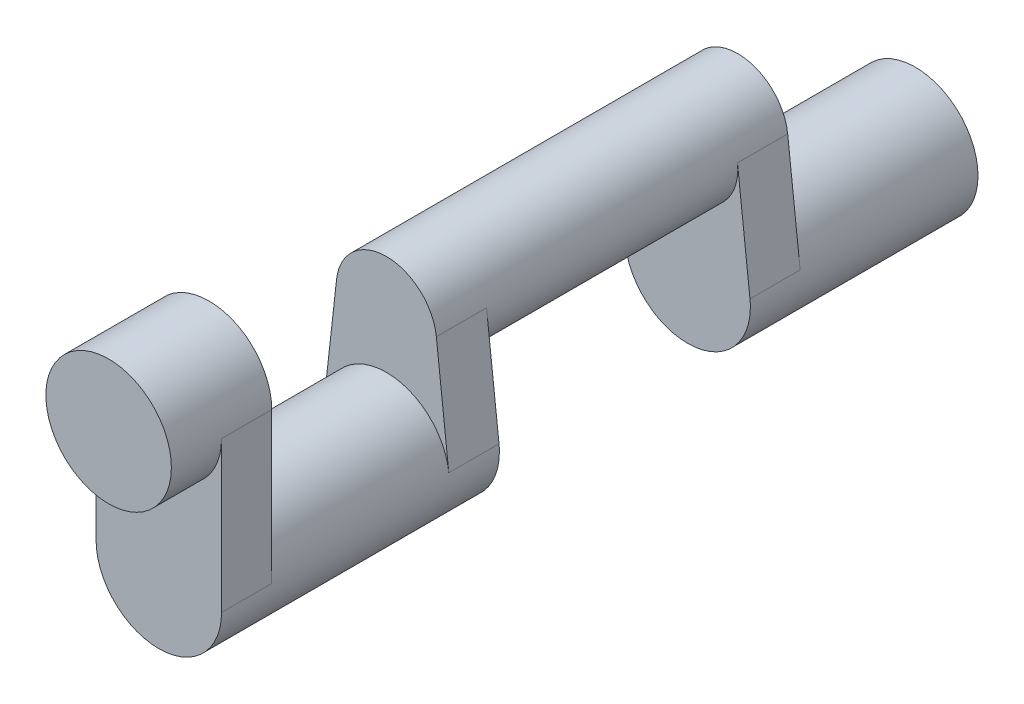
ISO-10303-21;
HEADER;
FILE_DESCRIPTION(('STEP AP214'),'2;1');
FILE_NAME('part.step','',(''),(''),'','','');
FILE_SCHEMA(('AUTOMOTIVE_DESIGN { 1 0 10303 214 1 1 1 1 }'));
ENDSEC;
DATA;
#1=APPLICATION_CONTEXT('core data for automotive mechanical design processes');
#2=APPLICATION_PROTOCOL_DEFINITION('international standard','automotive_design',2000,#1);
#3=PRODUCT_CONTEXT('',#1,'mechanical');
#4=PRODUCT('Part','Part','',(#3));
#5=PRODUCT_RELATED_PRODUCT_CATEGORY('part','',(#4));
#6=PRODUCT_DEFINITION_FORMATION('','',#4);
#7=PRODUCT_DEFINITION_CONTEXT('part definition',#1,'design');
#8=PRODUCT_DEFINITION('design','',#6,#7);
#9=PRODUCT_DEFINITION_SHAPE('','',#8);
#10=(LENGTH_UNIT() NAMED_UNIT(*) SI_UNIT(.MILLI.,.METRE.));
#11=(NAMED_UNIT(*) PLANE_ANGLE_UNIT() SI_UNIT($,.RADIAN.));
#12=(NAMED_UNIT(*) SI_UNIT($,.STERADIAN.) SOLID_ANGLE_UNIT());
#13=UNCERTAINTY_MEASURE_WITH_UNIT(LENGTH_MEASURE(1.E-05),#10,'distance_accuracy_value','');
#14=(GEOMETRIC_REPRESENTATION_CONTEXT(3) GLOBAL_UNCERTAINTY_ASSIGNED_CONTEXT((#13)) GLOBAL_UNIT_ASSIGNED_CONTEXT((#10,
#11,#12)) REPRESENTATION_CONTEXT('',''));
#15=CARTESIAN_POINT('',(0.,0.,0.));
#16=DIRECTION('',(0.,0.,1.));
#17=DIRECTION('',(1.,0.,0.));
#18=AXIS2_PLACEMENT_3D('',#15,#16,#17);
#19=CARTESIAN_POINT('',(0.,0.,38.1));
#20=DIRECTION('',(0.,0.,-1.));
#21=DIRECTION('',(-1.,0.,0.));
#22=AXIS2_PLACEMENT_3D('',#19,#20,#21);
#23=PLANE('',#22);
#24=CARTESIAN_POINT('',(0.,76.2,38.1));
#25=DIRECTION('',(0.,0.,1.));
#26=DIRECTION('',(1.,0.,0.));
#27=AXIS2_PLACEMENT_3D('',#24,#25,#26);
#28=CIRCLE('',#27,31.75);
#29=CARTESIAN_POINT('',(-31.75,76.2,38.1));
#30=VERTEX_POINT('',#29);
#31=CARTESIAN_POINT('',(31.75,76.2,38.1));
#32=VERTEX_POINT('',#31);
#33=EDGE_CURVE('E11',#30,#32,#28,.T.);
#34=ORIENTED_EDGE('',*,*,#33,.F.);
#35=DIRECTION('',(0.,-1.,0.));
#36=VECTOR('',#35,1.);
#37=CARTESIAN_POINT('',(-31.75,0.,38.1));
#38=LINE('',#37,#36);
#39=CARTESIAN_POINT('',(-31.75,0.,38.1));
#40=VERTEX_POINT('',#39);
#41=EDGE_CURVE('E142',#30,#40,#38,.T.);
#42=ORIENTED_EDGE('',*,*,#41,.T.);
#43=CARTESIAN_POINT('',(0.,0.,38.1));
#44=DIRECTION('',(0.,0.,1.));
#45=DIRECTION('',(-1.,0.,0.));
#46=AXIS2_PLACEMENT_3D('',#43,#44,#45);
#47=CIRCLE('',#46,31.75);
#48=CARTESIAN_POINT('',(31.75,0.,38.1));
#49=VERTEX_POINT('',#48);
#50=EDGE_CURVE('E140',#40,#49,#47,.T.);
#51=ORIENTED_EDGE('',*,*,#50,.T.);
#52=DIRECTION('',(0.,1.,0.));
#53=VECTOR('',#52,1.);
#54=CARTESIAN_POINT('',(31.75,0.,38.1));
#55=LINE('',#54,#53);
#56=EDGE_CURVE('E129',#49,#32,#55,.T.);
#57=ORIENTED_EDGE('',*,*,#56,.T.);
#58=EDGE_LOOP('',(#34,#42,#51,#57));
#59=FACE_BOUND('',#58,.T.);
#60=ADVANCED_FACE('F33',(#59),#23,.F.);
#61=CARTESIAN_POINT('',(0.,0.,-102.501929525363));
#62=DIRECTION('',(0.,0.,1.));
#63=DIRECTION('',(1.,0.,0.));
#64=AXIS2_PLACEMENT_3D('',#61,#62,#63);
#65=PLANE('',#64);
#66=CARTESIAN_POINT('',(0.,57.15,-102.501929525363));
#67=DIRECTION('',(0.,0.,-1.));
#68=DIRECTION('',(-1.,0.,0.));
#69=AXIS2_PLACEMENT_3D('',#66,#67,#68);
#70=CIRCLE('',#69,25.4);
#71=CARTESIAN_POINT('',(25.2427229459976,59.9722222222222,-102.501929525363));
#72=VERTEX_POINT('',#71);
#73=CARTESIAN_POINT('',(-25.2427229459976,59.9722222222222,-102.501929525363));
#74=VERTEX_POINT('',#73);
#75=EDGE_CURVE('E42',#72,#74,#70,.T.);
#76=ORIENTED_EDGE('',*,*,#75,.F.);
#77=DIRECTION('',(0.111111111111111,-0.993807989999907,0.));
#78=VECTOR('',#77,1.);
#79=CARTESIAN_POINT('',(31.553403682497,3.52777777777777,-102.501929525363));
#80=LINE('',#79,#78);
#81=CARTESIAN_POINT('',(31.553403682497,3.52777777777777,-102.501929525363));
#82=VERTEX_POINT('',#81);
#83=EDGE_CURVE('E185',#72,#82,#80,.T.);
#84=ORIENTED_EDGE('',*,*,#83,.T.);
#85=CARTESIAN_POINT('',(0.,0.,-102.501929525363));
#86=DIRECTION('',(0.,0.,-1.));
#87=DIRECTION('',(1.,0.,0.));
#88=AXIS2_PLACEMENT_3D('',#85,#86,#87);
#89=CIRCLE('',#88,31.75);
#90=CARTESIAN_POINT('',(-31.553403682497,3.52777777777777,-102.501929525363));
#91=VERTEX_POINT('',#90);
#92=EDGE_CURVE('E209',#82,#91,#89,.T.);
#93=ORIENTED_EDGE('',*,*,#92,.T.);
#94=DIRECTION('',(0.111111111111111,0.993807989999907,0.));
#95=VECTOR('',#94,1.);
#96=CARTESIAN_POINT('',(-31.553403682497,3.52777777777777,-102.501929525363));
#97=LINE('',#96,#95);
#98=EDGE_CURVE('E188',#91,#74,#97,.T.);
#99=ORIENTED_EDGE('',*,*,#98,.T.);
#100=EDGE_LOOP('',(#76,#84,#93,#99));
#101=FACE_BOUND('',#100,.T.);
#102=ADVANCED_FACE('F257',(#101),#65,.F.);
#103=CARTESIAN_POINT('',(0.,0.,-166.904490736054));
#104=DIRECTION('',(0.,0.,1.));
#105=DIRECTION('',(1.,0.,0.));
#106=AXIS2_PLACEMENT_3D('',#103,#104,#105);
#107=CYLINDRICAL_SURFACE('',#106,31.75);
#108=CARTESIAN_POINT('',(0.,0.,-77.1019295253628));
#109=DIRECTION('',(0.,0.,1.));
#110=DIRECTION('',(1.,0.,0.));
#111=AXIS2_PLACEMENT_3D('',#108,#109,#110);
#112=CIRCLE('',#111,31.75);
#113=CARTESIAN_POINT('',(-31.553403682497,3.52777777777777,-77.1019295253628));
#114=VERTEX_POINT('',#113);
#115=CARTESIAN_POINT('',(31.553403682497,3.52777777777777,-77.1019295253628));
#116=VERTEX_POINT('',#115);
#117=EDGE_CURVE('E58',#114,#116,#112,.F.);
#118=ORIENTED_EDGE('',*,*,#117,.F.);
#119=DIRECTION('',(0.,0.,1.));
#120=VECTOR('',#119,1.);
#121=CARTESIAN_POINT('',(-31.553403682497,3.52777777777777,-102.501929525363));
#122=LINE('',#121,#120);
#123=EDGE_CURVE('E182',#91,#114,#122,.T.);
#124=ORIENTED_EDGE('',*,*,#123,.F.);
#125=ORIENTED_EDGE('',*,*,#92,.F.);
#126=DIRECTION('',(0.,0.,1.));
#127=VECTOR('',#126,1.);
#128=CARTESIAN_POINT('',(31.553403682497,3.52777777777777,-102.501929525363));
#129=LINE('',#128,#127);
#130=EDGE_CURVE('E187',#82,#116,#129,.T.);
#131=ORIENTED_EDGE('',*,*,#130,.T.);
#132=EDGE_LOOP('',(#118,#124,#125,#131));
#133=FACE_BOUND('',#132,.T.);
#134=CARTESIAN_POINT('',(0.,0.,12.7));
#135=DIRECTION('',(0.,0.,1.));
#136=DIRECTION('',(1.,0.,0.));
#137=AXIS2_PLACEMENT_3D('',#134,#135,#136);
#138=CIRCLE('',#137,31.75);
#139=CARTESIAN_POINT('',(31.75,0.,12.7));
#140=VERTEX_POINT('',#139);
#141=CARTESIAN_POINT('',(-31.75,0.,12.7));
#142=VERTEX_POINT('',#141);
#143=EDGE_CURVE('E50',#140,#142,#138,.T.);
#144=ORIENTED_EDGE('',*,*,#143,.F.);
#145=DIRECTION('',(0.,0.,-1.));
#146=VECTOR('',#145,1.);
#147=CARTESIAN_POINT('',(31.75,0.,38.1));
#148=LINE('',#147,#146);
#149=EDGE_CURVE('E134',#49,#140,#148,.T.);
#150=ORIENTED_EDGE('',*,*,#149,.F.);
#151=ORIENTED_EDGE('',*,*,#50,.F.);
#152=DIRECTION('',(0.,0.,-1.));
#153=VECTOR('',#152,1.);
#154=CARTESIAN_POINT('',(-31.75,0.,38.1));
#155=LINE('',#154,#153);
#156=EDGE_CURVE('E150',#40,#142,#155,.T.);
#157=ORIENTED_EDGE('',*,*,#156,.T.);
#158=EDGE_LOOP('',(#144,#150,#151,#157));
#159=FACE_BOUND('',#158,.T.);
#160=ADVANCED_FACE('F35',(#133,#159),#107,.T.);
#161=CARTESIAN_POINT('',(-31.553403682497,3.52777777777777,-102.501929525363));
#162=DIRECTION('',(0.993807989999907,-0.111111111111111,0.));
#163=DIRECTION('',(0.111111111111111,0.993807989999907,0.));
#164=AXIS2_PLACEMENT_3D('',#161,#162,#163);
#165=PLANE('',#164);
#166=DIRECTION('',(0.111111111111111,0.993807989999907,0.));
#167=VECTOR('',#166,1.);
#168=CARTESIAN_POINT('',(-31.553403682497,3.52777777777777,-77.1019295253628));
#169=LINE('',#168,#167);
#170=CARTESIAN_POINT('',(-25.2427229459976,59.9722222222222,-77.1019295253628));
#171=VERTEX_POINT('',#170);
#172=EDGE_CURVE('E223',#114,#171,#169,.T.);
#173=ORIENTED_EDGE('',*,*,#172,.T.);
#174=DIRECTION('',(0.,0.,1.));
#175=VECTOR('',#174,1.);
#176=CARTESIAN_POINT('',(-25.2427229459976,59.9722222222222,-102.501929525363));
#177=LINE('',#176,#175);
#178=EDGE_CURVE('E194',#74,#171,#177,.T.);
#179=ORIENTED_EDGE('',*,*,#178,.F.);
#180=ORIENTED_EDGE('',*,*,#98,.F.);
#181=ORIENTED_EDGE('',*,*,#123,.T.);
#182=EDGE_LOOP('',(#173,#179,#180,#181));
#183=FACE_BOUND('',#182,.T.);
#184=ADVANCED_FACE('F250',(#183),#165,.F.);
#185=CARTESIAN_POINT('',(0.,57.15,-102.501929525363));
#186=DIRECTION('',(0.,0.,1.));
#187=DIRECTION('',(1.,0.,0.));
#188=AXIS2_PLACEMENT_3D('',#185,#186,#187);
#189=CYLINDRICAL_SURFACE('',#188,25.4);
#190=CARTESIAN_POINT('',(0.,57.15,-77.1019295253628));
#191=DIRECTION('',(0.,0.,-1.));
#192=DIRECTION('',(-1.,0.,0.));
#193=AXIS2_PLACEMENT_3D('',#190,#191,#192);
#194=CIRCLE('',#193,25.4);
#195=CARTESIAN_POINT('',(25.2427229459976,59.9722222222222,-77.1019295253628));
#196=VERTEX_POINT('',#195);
#197=EDGE_CURVE('E216',#171,#196,#194,.T.);
#198=ORIENTED_EDGE('',*,*,#197,.T.);
#199=DIRECTION('',(0.,0.,1.));
#200=VECTOR('',#199,1.);
#201=CARTESIAN_POINT('',(25.2427229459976,59.9722222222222,-102.501929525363));
#202=LINE('',#201,#200);
#203=EDGE_CURVE('E191',#72,#196,#202,.T.);
#204=ORIENTED_EDGE('',*,*,#203,.F.);
#205=ORIENTED_EDGE('',*,*,#75,.T.);
#206=ORIENTED_EDGE('',*,*,#178,.T.);
#207=EDGE_LOOP('',(#198,#204,#205,#206));
#208=FACE_BOUND('',#207,.T.);
#209=CARTESIAN_POINT('',(0.,57.15,-254.901929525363));
#210=DIRECTION('',(0.,0.,-1.));
#211=DIRECTION('',(-1.,0.,0.));
#212=AXIS2_PLACEMENT_3D('',#209,#210,#211);
#213=CIRCLE('',#212,25.4);
#214=CARTESIAN_POINT('',(-25.2427229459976,59.9722222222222,-254.901929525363));
#215=VERTEX_POINT('',#214);
#216=CARTESIAN_POINT('',(25.2427229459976,59.9722222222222,-254.901929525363));
#217=VERTEX_POINT('',#216);
#218=EDGE_CURVE('E441',#215,#217,#213,.T.);
#219=ORIENTED_EDGE('',*,*,#218,.F.);
#220=DIRECTION('',(0.,0.,-1.));
#221=VECTOR('',#220,1.);
#222=CARTESIAN_POINT('',(-25.2427229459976,59.9722222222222,-229.501929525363));
#223=LINE('',#222,#221);
#224=CARTESIAN_POINT('',(-25.2427229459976,59.9722222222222,-229.501929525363));
#225=VERTEX_POINT('',#224);
#226=EDGE_CURVE('E459',#225,#215,#223,.T.);
#227=ORIENTED_EDGE('',*,*,#226,.F.);
#228=CARTESIAN_POINT('',(0.,57.15,-229.501929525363));
#229=DIRECTION('',(0.,0.,-1.));
#230=DIRECTION('',(-1.,0.,0.));
#231=AXIS2_PLACEMENT_3D('',#228,#229,#230);
#232=CIRCLE('',#231,25.4);
#233=CARTESIAN_POINT('',(25.2427229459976,59.9722222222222,-229.501929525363));
#234=VERTEX_POINT('',#233);
#235=EDGE_CURVE('E228',#234,#225,#232,.T.);
#236=ORIENTED_EDGE('',*,*,#235,.F.);
#237=DIRECTION('',(0.,0.,-1.));
#238=VECTOR('',#237,1.);
#239=CARTESIAN_POINT('',(25.2427229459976,59.9722222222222,-229.501929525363));
#240=LINE('',#239,#238);
#241=EDGE_CURVE('E468',#234,#217,#240,.T.);
#242=ORIENTED_EDGE('',*,*,#241,.T.);
#243=EDGE_LOOP('',(#219,#227,#236,#242));
#244=FACE_BOUND('',#243,.T.);
#245=ADVANCED_FACE('F247',(#208,#244),#189,.T.);
#246=CARTESIAN_POINT('',(31.553403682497,3.52777777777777,-102.501929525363));
#247=DIRECTION('',(-0.993807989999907,-0.111111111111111,0.));
#248=DIRECTION('',(0.111111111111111,-0.993807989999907,0.));
#249=AXIS2_PLACEMENT_3D('',#246,#247,#248);
#250=PLANE('',#249);
#251=DIRECTION('',(0.111111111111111,-0.993807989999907,0.));
#252=VECTOR('',#251,1.);
#253=CARTESIAN_POINT('',(31.553403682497,3.52777777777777,-77.1019295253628));
#254=LINE('',#253,#252);
#255=EDGE_CURVE('E212',#196,#116,#254,.T.);
#256=ORIENTED_EDGE('',*,*,#255,.T.);
#257=ORIENTED_EDGE('',*,*,#130,.F.);
#258=ORIENTED_EDGE('',*,*,#83,.F.);
#259=ORIENTED_EDGE('',*,*,#203,.T.);
#260=EDGE_LOOP('',(#256,#257,#258,#259));
#261=FACE_BOUND('',#260,.T.);
#262=ADVANCED_FACE('F242',(#261),#250,.F.);
#263=CARTESIAN_POINT('',(0.,0.,-77.1019295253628));
#264=DIRECTION('',(0.,0.,1.));
#265=DIRECTION('',(1.,0.,0.));
#266=AXIS2_PLACEMENT_3D('',#263,#264,#265);
#267=PLANE('',#266);
#268=ORIENTED_EDGE('',*,*,#172,.F.);
#269=ORIENTED_EDGE('',*,*,#117,.T.);
#270=ORIENTED_EDGE('',*,*,#255,.F.);
#271=ORIENTED_EDGE('',*,*,#197,.F.);
#272=EDGE_LOOP('',(#268,#269,#270,#271));
#273=FACE_BOUND('',#272,.T.);
#274=ADVANCED_FACE('F245',(#273),#267,.T.);
#275=CARTESIAN_POINT('',(0.,0.,-229.501929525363));
#276=DIRECTION('',(0.,0.,-1.));
#277=DIRECTION('',(1.,0.,0.));
#278=AXIS2_PLACEMENT_3D('',#275,#276,#277);
#279=PLANE('',#278);
#280=ORIENTED_EDGE('',*,*,#235,.T.);
#281=DIRECTION('',(0.111111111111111,0.993807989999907,0.));
#282=VECTOR('',#281,1.);
#283=CARTESIAN_POINT('',(-31.553403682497,3.52777777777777,-229.501929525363));
#284=LINE('',#283,#282);
#285=CARTESIAN_POINT('',(-31.553403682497,3.52777777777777,-229.501929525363));
#286=VERTEX_POINT('',#285);
#287=EDGE_CURVE('E439',#286,#225,#284,.T.);
#288=ORIENTED_EDGE('',*,*,#287,.F.);
#289=CARTESIAN_POINT('',(0.,0.,-229.501929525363));
#290=DIRECTION('',(0.,0.,-1.));
#291=DIRECTION('',(1.,0.,0.));
#292=AXIS2_PLACEMENT_3D('',#289,#290,#291);
#293=CIRCLE('',#292,31.75);
#294=CARTESIAN_POINT('',(31.553403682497,3.52777777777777,-229.501929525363));
#295=VERTEX_POINT('',#294);
#296=EDGE_CURVE('E436',#295,#286,#293,.T.);
#297=ORIENTED_EDGE('',*,*,#296,.F.);
#298=DIRECTION('',(0.111111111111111,-0.993807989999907,0.));
#299=VECTOR('',#298,1.);
#300=CARTESIAN_POINT('',(31.553403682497,3.52777777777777,-229.501929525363));
#301=LINE('',#300,#299);
#302=EDGE_CURVE('E469',#234,#295,#301,.T.);
#303=ORIENTED_EDGE('',*,*,#302,.F.);
#304=EDGE_LOOP('',(#280,#288,#297,#303));
#305=FACE_BOUND('',#304,.T.);
#306=ADVANCED_FACE('F277',(#305),#279,.F.);
#307=CARTESIAN_POINT('',(0.,0.,-165.099368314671));
#308=DIRECTION('',(0.,0.,-1.));
#309=DIRECTION('',(1.,0.,0.));
#310=AXIS2_PLACEMENT_3D('',#307,#308,#309);
#311=CYLINDRICAL_SURFACE('',#310,31.75);
#312=CARTESIAN_POINT('',(0.,0.,-254.901929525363));
#313=DIRECTION('',(0.,0.,1.));
#314=DIRECTION('',(1.,0.,0.));
#315=AXIS2_PLACEMENT_3D('',#312,#313,#314);
#316=CIRCLE('',#315,31.75);
#317=CARTESIAN_POINT('',(-31.553403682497,3.52777777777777,-254.901929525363));
#318=VERTEX_POINT('',#317);
#319=CARTESIAN_POINT('',(31.553403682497,3.52777777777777,-254.901929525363));
#320=VERTEX_POINT('',#319);
#321=EDGE_CURVE('E447',#318,#320,#316,.F.);
#322=ORIENTED_EDGE('',*,*,#321,.T.);
#323=DIRECTION('',(0.,0.,-1.));
#324=VECTOR('',#323,1.);
#325=CARTESIAN_POINT('',(31.553403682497,3.52777777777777,-229.501929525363));
#326=LINE('',#325,#324);
#327=EDGE_CURVE('E465',#295,#320,#326,.T.);
#328=ORIENTED_EDGE('',*,*,#327,.F.);
#329=ORIENTED_EDGE('',*,*,#296,.T.);
#330=DIRECTION('',(0.,0.,-1.));
#331=VECTOR('',#330,1.);
#332=CARTESIAN_POINT('',(-31.553403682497,3.52777777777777,-229.501929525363));
#333=LINE('',#332,#331);
#334=EDGE_CURVE('E448',#286,#318,#333,.T.);
#335=ORIENTED_EDGE('',*,*,#334,.T.);
#336=EDGE_LOOP('',(#322,#328,#329,#335));
#337=FACE_BOUND('',#336,.T.);
#338=CARTESIAN_POINT('',(0.,0.,-344.703859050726));
#339=DIRECTION('',(0.,0.,1.));
#340=DIRECTION('',(1.,0.,0.));
#341=AXIS2_PLACEMENT_3D('',#338,#339,#340);
#342=CIRCLE('',#341,31.75);
#343=CARTESIAN_POINT('',(31.75,0.,-344.703859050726));
#344=VERTEX_POINT('',#343);
#345=EDGE_CURVE('E444',#344,#344,#342,.T.);
#346=ORIENTED_EDGE('',*,*,#345,.T.);
#347=EDGE_LOOP('',(#346));
#348=FACE_BOUND('',#347,.T.);
#349=ADVANCED_FACE('F280',(#337,#348),#311,.T.);
#350=CARTESIAN_POINT('',(0.,0.,-344.703859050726));
#351=DIRECTION('',(0.,0.,-1.));
#352=DIRECTION('',(1.,0.,0.));
#353=AXIS2_PLACEMENT_3D('',#350,#351,#352);
#354=PLANE('',#353);
#355=ORIENTED_EDGE('',*,*,#345,.F.);
#356=EDGE_LOOP('',(#355));
#357=FACE_BOUND('',#356,.T.);
#358=ADVANCED_FACE('F292',(#357),#354,.T.);
#359=CARTESIAN_POINT('',(-31.553403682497,3.52777777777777,-229.501929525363));
#360=DIRECTION('',(0.993807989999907,-0.111111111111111,0.));
#361=DIRECTION('',(0.111111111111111,0.993807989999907,0.));
#362=AXIS2_PLACEMENT_3D('',#359,#360,#361);
#363=PLANE('',#362);
#364=DIRECTION('',(0.111111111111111,0.993807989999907,0.));
#365=VECTOR('',#364,1.);
#366=CARTESIAN_POINT('',(-31.553403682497,3.52777777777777,-254.901929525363));
#367=LINE('',#366,#365);
#368=EDGE_CURVE('E174',#318,#215,#367,.T.);
#369=ORIENTED_EDGE('',*,*,#368,.F.);
#370=ORIENTED_EDGE('',*,*,#334,.F.);
#371=ORIENTED_EDGE('',*,*,#287,.T.);
#372=ORIENTED_EDGE('',*,*,#226,.T.);
#373=EDGE_LOOP('',(#369,#370,#371,#372));
#374=FACE_BOUND('',#373,.T.);
#375=ADVANCED_FACE('F288',(#374),#363,.F.);
#376=CARTESIAN_POINT('',(31.553403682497,3.52777777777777,-229.501929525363));
#377=DIRECTION('',(-0.993807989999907,-0.111111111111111,0.));
#378=DIRECTION('',(0.111111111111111,-0.993807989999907,0.));
#379=AXIS2_PLACEMENT_3D('',#376,#377,#378);
#380=PLANE('',#379);
#381=DIRECTION('',(0.111111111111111,-0.993807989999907,0.));
#382=VECTOR('',#381,1.);
#383=CARTESIAN_POINT('',(31.553403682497,3.52777777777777,-254.901929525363));
#384=LINE('',#383,#382);
#385=EDGE_CURVE('E440',#217,#320,#384,.T.);
#386=ORIENTED_EDGE('',*,*,#385,.F.);
#387=ORIENTED_EDGE('',*,*,#241,.F.);
#388=ORIENTED_EDGE('',*,*,#302,.T.);
#389=ORIENTED_EDGE('',*,*,#327,.T.);
#390=EDGE_LOOP('',(#386,#387,#388,#389));
#391=FACE_BOUND('',#390,.T.);
#392=ADVANCED_FACE('F284',(#391),#380,.F.);
#393=CARTESIAN_POINT('',(0.,0.,-254.901929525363));
#394=DIRECTION('',(0.,0.,-1.));
#395=DIRECTION('',(1.,0.,0.));
#396=AXIS2_PLACEMENT_3D('',#393,#394,#395);
#397=PLANE('',#396);
#398=ORIENTED_EDGE('',*,*,#368,.T.);
#399=ORIENTED_EDGE('',*,*,#218,.T.);
#400=ORIENTED_EDGE('',*,*,#385,.T.);
#401=ORIENTED_EDGE('',*,*,#321,.F.);
#402=EDGE_LOOP('',(#398,#399,#400,#401));
#403=FACE_BOUND('',#402,.T.);
#404=ADVANCED_FACE('F276',(#403),#397,.T.);
#405=CARTESIAN_POINT('',(31.75,0.,38.1));
#406=DIRECTION('',(-1.,0.,0.));
#407=DIRECTION('',(0.,0.,1.));
#408=AXIS2_PLACEMENT_3D('',#405,#406,#407);
#409=PLANE('',#408);
#410=DIRECTION('',(0.,1.,0.));
#411=VECTOR('',#410,1.);
#412=CARTESIAN_POINT('',(31.75,0.,12.7));
#413=LINE('',#412,#411);
#414=CARTESIAN_POINT('',(31.75,76.2,12.7));
#415=VERTEX_POINT('',#414);
#416=EDGE_CURVE('E131',#140,#415,#413,.T.);
#417=ORIENTED_EDGE('',*,*,#416,.T.);
#418=DIRECTION('',(0.,0.,-1.));
#419=VECTOR('',#418,1.);
#420=CARTESIAN_POINT('',(31.75,76.2,38.1));
#421=LINE('',#420,#419);
#422=EDGE_CURVE('E125',#32,#415,#421,.T.);
#423=ORIENTED_EDGE('',*,*,#422,.F.);
#424=ORIENTED_EDGE('',*,*,#56,.F.);
#425=ORIENTED_EDGE('',*,*,#149,.T.);
#426=EDGE_LOOP('',(#417,#423,#424,#425));
#427=FACE_BOUND('',#426,.T.);
#428=ADVANCED_FACE('F127',(#427),#409,.F.);
#429=CARTESIAN_POINT('',(0.,76.2,38.1));
#430=DIRECTION('',(0.,0.,-1.));
#431=DIRECTION('',(-1.,0.,0.));
#432=AXIS2_PLACEMENT_3D('',#429,#430,#431);
#433=CYLINDRICAL_SURFACE('',#432,31.75);
#434=CARTESIAN_POINT('',(0.,76.2,12.7));
#435=DIRECTION('',(0.,0.,1.));
#436=DIRECTION('',(1.,0.,0.));
#437=AXIS2_PLACEMENT_3D('',#434,#435,#436);
#438=CIRCLE('',#437,31.75);
#439=CARTESIAN_POINT('',(-31.75,76.2,12.7));
#440=VERTEX_POINT('',#439);
#441=EDGE_CURVE('E148',#415,#440,#438,.T.);
#442=ORIENTED_EDGE('',*,*,#441,.T.);
#443=DIRECTION('',(0.,0.,-1.));
#444=VECTOR('',#443,1.);
#445=CARTESIAN_POINT('',(-31.75,76.2,38.1));
#446=LINE('',#445,#444);
#447=EDGE_CURVE('E135',#30,#440,#446,.T.);
#448=ORIENTED_EDGE('',*,*,#447,.F.);
#449=ORIENTED_EDGE('',*,*,#33,.T.);
#450=ORIENTED_EDGE('',*,*,#422,.T.);
#451=EDGE_LOOP('',(#442,#448,#449,#450));
#452=FACE_BOUND('',#451,.T.);
#453=CARTESIAN_POINT('',(0.,76.2,63.5));
#454=DIRECTION('',(0.,0.,1.));
#455=DIRECTION('',(1.,0.,0.));
#456=AXIS2_PLACEMENT_3D('',#453,#454,#455);
#457=CIRCLE('',#456,31.75);
#458=CARTESIAN_POINT('',(31.75,76.2,63.5));
#459=VERTEX_POINT('',#458);
#460=EDGE_CURVE('E178',#459,#459,#457,.T.);
#461=ORIENTED_EDGE('',*,*,#460,.F.);
#462=EDGE_LOOP('',(#461));
#463=FACE_BOUND('',#462,.T.);
#464=ADVANCED_FACE('F144',(#452,#463),#433,.T.);
#465=CARTESIAN_POINT('',(-31.75,0.,38.1));
#466=DIRECTION('',(1.,0.,0.));
#467=DIRECTION('',(0.,0.,-1.));
#468=AXIS2_PLACEMENT_3D('',#465,#466,#467);
#469=PLANE('',#468);
#470=DIRECTION('',(0.,-1.,0.));
#471=VECTOR('',#470,1.);
#472=CARTESIAN_POINT('',(-31.75,0.,12.7));
#473=LINE('',#472,#471);
#474=EDGE_CURVE('E169',#440,#142,#473,.T.);
#475=ORIENTED_EDGE('',*,*,#474,.T.);
#476=ORIENTED_EDGE('',*,*,#156,.F.);
#477=ORIENTED_EDGE('',*,*,#41,.F.);
#478=ORIENTED_EDGE('',*,*,#447,.T.);
#479=EDGE_LOOP('',(#475,#476,#477,#478));
#480=FACE_BOUND('',#479,.T.);
#481=ADVANCED_FACE('F153',(#480),#469,.F.);
#482=CARTESIAN_POINT('',(0.,0.,12.7));
#483=DIRECTION('',(0.,0.,-1.));
#484=DIRECTION('',(-1.,0.,0.));
#485=AXIS2_PLACEMENT_3D('',#482,#483,#484);
#486=PLANE('',#485);
#487=ORIENTED_EDGE('',*,*,#416,.F.);
#488=ORIENTED_EDGE('',*,*,#143,.T.);
#489=ORIENTED_EDGE('',*,*,#474,.F.);
#490=ORIENTED_EDGE('',*,*,#441,.F.);
#491=EDGE_LOOP('',(#487,#488,#489,#490));
#492=FACE_BOUND('',#491,.T.);
#493=ADVANCED_FACE('F267',(#492),#486,.T.);
#494=CARTESIAN_POINT('',(0.,76.2,63.5));
#495=DIRECTION('',(0.,0.,1.));
#496=DIRECTION('',(1.,0.,0.));
#497=AXIS2_PLACEMENT_3D('',#494,#495,#496);
#498=PLANE('',#497);
#499=ORIENTED_EDGE('',*,*,#460,.T.);
#500=EDGE_LOOP('',(#499));
#501=FACE_BOUND('',#500,.T.);
#502=ADVANCED_FACE('F266',(#501),#498,.T.);
#503=CLOSED_SHELL('',(#60,#102,#160,#184,#245,#262,#274,#306,#349,#358,#375,#392,#404,#428,#464,
#481,#493,#502));
#504=MANIFOLD_SOLID_BREP('B2',#503);
#505=ADVANCED_BREP_SHAPE_REPRESENTATION('',(#18,#504),#14);
#506=SHAPE_DEFINITION_REPRESENTATION(#9,#505);
ENDSEC;
END-ISO-10303-21;
